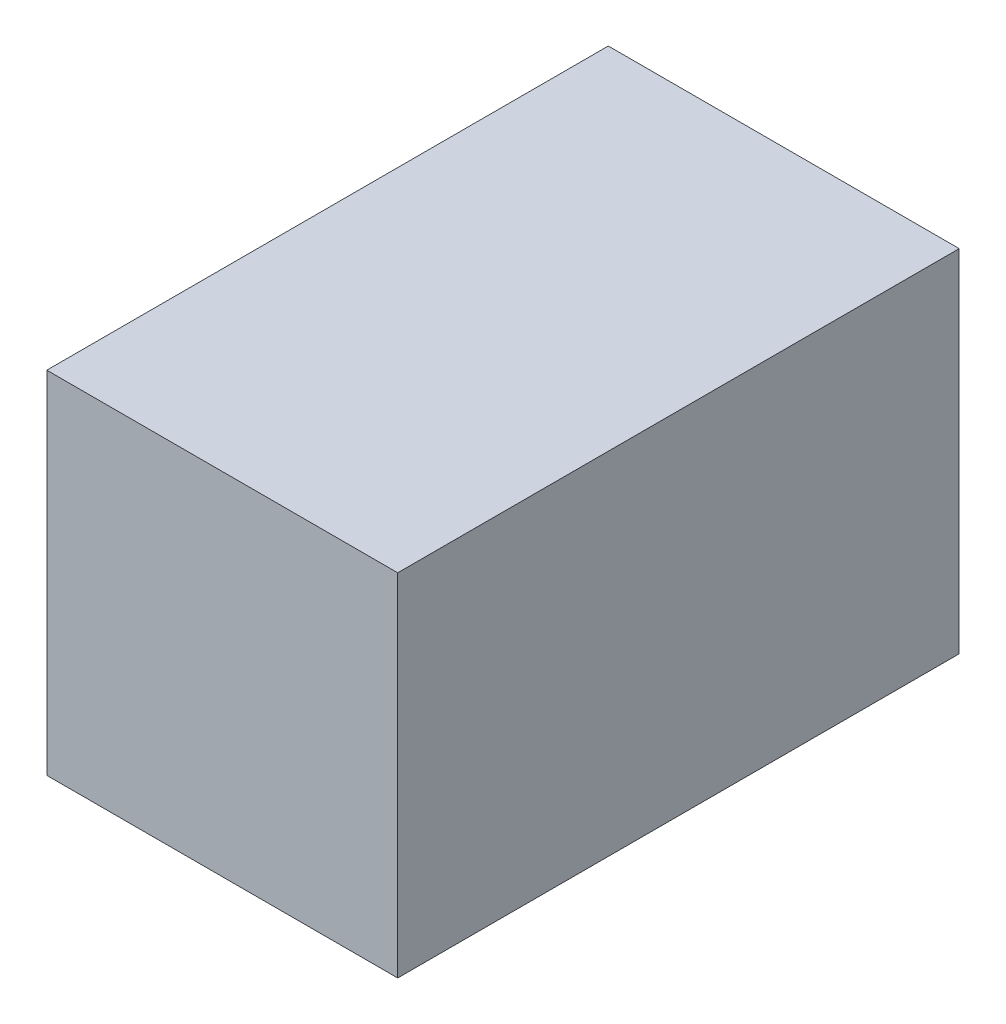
from build123d import *

# Parameters (mm, degrees)
SKETCH1_W      = 2.38125
SKETCH1_H      = 2.38125
EXTRUDE1_DEPTH = 3.81


with BuildPart() as part:
    # sketch1 → Extrude1 (new body)
    with BuildSketch(Plane.XY):
        Rectangle(SKETCH1_W, SKETCH1_H)
    extrude(amount=EXTRUDE1_DEPTH)


solid = part.part
